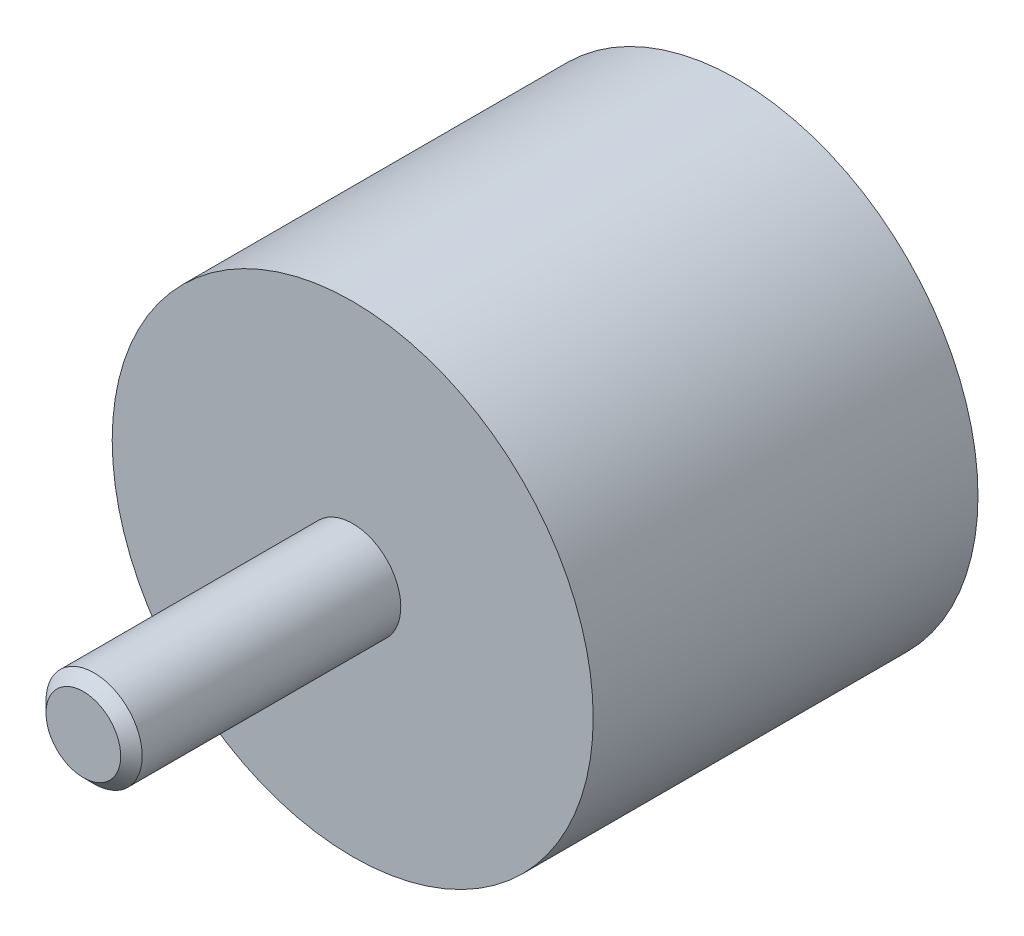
ISO-10303-21;
HEADER;
FILE_DESCRIPTION(('STEP AP214'),'2;1');
FILE_NAME('part.step','',(''),(''),'','','');
FILE_SCHEMA(('AUTOMOTIVE_DESIGN { 1 0 10303 214 1 1 1 1 }'));
ENDSEC;
DATA;
#1=APPLICATION_CONTEXT('core data for automotive mechanical design processes');
#2=APPLICATION_PROTOCOL_DEFINITION('international standard','automotive_design',2000,#1);
#3=PRODUCT_CONTEXT('',#1,'mechanical');
#4=PRODUCT('Part','Part','',(#3));
#5=PRODUCT_RELATED_PRODUCT_CATEGORY('part','',(#4));
#6=PRODUCT_DEFINITION_FORMATION('','',#4);
#7=PRODUCT_DEFINITION_CONTEXT('part definition',#1,'design');
#8=PRODUCT_DEFINITION('design','',#6,#7);
#9=PRODUCT_DEFINITION_SHAPE('','',#8);
#10=(LENGTH_UNIT() NAMED_UNIT(*) SI_UNIT(.MILLI.,.METRE.));
#11=(NAMED_UNIT(*) PLANE_ANGLE_UNIT() SI_UNIT($,.RADIAN.));
#12=(NAMED_UNIT(*) SI_UNIT($,.STERADIAN.) SOLID_ANGLE_UNIT());
#13=UNCERTAINTY_MEASURE_WITH_UNIT(LENGTH_MEASURE(1.E-05),#10,'distance_accuracy_value','');
#14=(GEOMETRIC_REPRESENTATION_CONTEXT(3) GLOBAL_UNCERTAINTY_ASSIGNED_CONTEXT((#13)) GLOBAL_UNIT_ASSIGNED_CONTEXT((#10,
#11,#12)) REPRESENTATION_CONTEXT('',''));
#15=CARTESIAN_POINT('',(0.,0.,0.));
#16=DIRECTION('',(0.,0.,1.));
#17=DIRECTION('',(1.,0.,0.));
#18=AXIS2_PLACEMENT_3D('',#15,#16,#17);
#19=CARTESIAN_POINT('',(0.,0.,0.));
#20=DIRECTION('',(0.,0.,1.));
#21=DIRECTION('',(0.,-1.,0.));
#22=AXIS2_PLACEMENT_3D('',#19,#20,#21);
#23=CYLINDRICAL_SURFACE('',#22,25.);
#24=CARTESIAN_POINT('',(0.,0.,0.));
#25=DIRECTION('',(0.,0.,1.));
#26=DIRECTION('',(0.,-1.,0.));
#27=AXIS2_PLACEMENT_3D('',#24,#25,#26);
#28=CIRCLE('',#27,25.);
#29=CARTESIAN_POINT('',(0.,-25.,0.));
#30=VERTEX_POINT('',#29);
#31=EDGE_CURVE('E18',#30,#30,#28,.T.);
#32=ORIENTED_EDGE('',*,*,#31,.T.);
#33=EDGE_LOOP('',(#32));
#34=FACE_BOUND('',#33,.T.);
#35=CARTESIAN_POINT('',(0.,0.,40.));
#36=DIRECTION('',(0.,0.,-1.));
#37=DIRECTION('',(0.,1.,0.));
#38=AXIS2_PLACEMENT_3D('',#35,#36,#37);
#39=CIRCLE('',#38,25.);
#40=CARTESIAN_POINT('',(0.,25.,40.));
#41=VERTEX_POINT('',#40);
#42=EDGE_CURVE('E22',#41,#41,#39,.T.);
#43=ORIENTED_EDGE('',*,*,#42,.T.);
#44=EDGE_LOOP('',(#43));
#45=FACE_BOUND('',#44,.T.);
#46=ADVANCED_FACE('F12',(#34,#45),#23,.T.);
#47=CARTESIAN_POINT('',(25.,0.,0.));
#48=DIRECTION('',(0.,0.,-1.));
#49=DIRECTION('',(0.,1.,0.));
#50=AXIS2_PLACEMENT_3D('',#47,#48,#49);
#51=PLANE('',#50);
#52=ORIENTED_EDGE('',*,*,#31,.F.);
#53=EDGE_LOOP('',(#52));
#54=FACE_BOUND('',#53,.T.);
#55=ADVANCED_FACE('F48',(#54),#51,.T.);
#56=CARTESIAN_POINT('',(25.,0.,40.));
#57=DIRECTION('',(0.,0.,1.));
#58=DIRECTION('',(0.,-1.,0.));
#59=AXIS2_PLACEMENT_3D('',#56,#57,#58);
#60=PLANE('',#59);
#61=CARTESIAN_POINT('',(0.,0.,40.));
#62=DIRECTION('',(0.,0.,1.));
#63=DIRECTION('',(0.,-1.,0.));
#64=AXIS2_PLACEMENT_3D('',#61,#62,#63);
#65=CIRCLE('',#64,5.);
#66=CARTESIAN_POINT('',(0.,-5.,40.));
#67=VERTEX_POINT('',#66);
#68=EDGE_CURVE('E8',#67,#67,#65,.F.);
#69=ORIENTED_EDGE('',*,*,#68,.T.);
#70=EDGE_LOOP('',(#69));
#71=FACE_BOUND('',#70,.T.);
#72=ORIENTED_EDGE('',*,*,#42,.F.);
#73=EDGE_LOOP('',(#72));
#74=FACE_BOUND('',#73,.T.);
#75=ADVANCED_FACE('F52',(#71,#74),#60,.T.);
#76=CARTESIAN_POINT('',(0.,0.,20.));
#77=DIRECTION('',(0.,0.,1.));
#78=DIRECTION('',(0.,-1.,0.));
#79=AXIS2_PLACEMENT_3D('',#76,#77,#78);
#80=CYLINDRICAL_SURFACE('',#79,5.);
#81=ORIENTED_EDGE('',*,*,#68,.F.);
#82=EDGE_LOOP('',(#81));
#83=FACE_BOUND('',#82,.T.);
#84=CARTESIAN_POINT('',(0.,0.,66.8809789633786));
#85=DIRECTION('',(0.,0.,-1.));
#86=DIRECTION('',(0.,1.,0.));
#87=AXIS2_PLACEMENT_3D('',#84,#85,#86);
#88=CIRCLE('',#87,5.);
#89=CARTESIAN_POINT('',(0.,5.,66.8809789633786));
#90=VERTEX_POINT('',#89);
#91=EDGE_CURVE('E26',#90,#90,#88,.T.);
#92=ORIENTED_EDGE('',*,*,#91,.T.);
#93=EDGE_LOOP('',(#92));
#94=FACE_BOUND('',#93,.T.);
#95=ADVANCED_FACE('F45',(#83,#94),#80,.T.);
#96=CARTESIAN_POINT('',(0.,0.,66.8809789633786));
#97=DIRECTION('',(0.,0.,-1.));
#98=DIRECTION('',(0.,1.,0.));
#99=AXIS2_PLACEMENT_3D('',#96,#97,#98);
#100=CONICAL_SURFACE('',#99,5.,0.78539816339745);
#101=CARTESIAN_POINT('',(0.,0.,68.));
#102=DIRECTION('',(0.,0.,-1.));
#103=DIRECTION('',(0.,1.,0.));
#104=AXIS2_PLACEMENT_3D('',#101,#102,#103);
#105=CIRCLE('',#104,3.88097896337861);
#106=CARTESIAN_POINT('',(0.,3.88097896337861,68.));
#107=VERTEX_POINT('',#106);
#108=EDGE_CURVE('E31',#107,#107,#105,.T.);
#109=ORIENTED_EDGE('',*,*,#108,.T.);
#110=EDGE_LOOP('',(#109));
#111=FACE_BOUND('',#110,.T.);
#112=ORIENTED_EDGE('',*,*,#91,.F.);
#113=EDGE_LOOP('',(#112));
#114=FACE_BOUND('',#113,.T.);
#115=ADVANCED_FACE('F35',(#111,#114),#100,.T.);
#116=CARTESIAN_POINT('',(3.88097896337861,0.,68.));
#117=DIRECTION('',(0.,0.,1.));
#118=DIRECTION('',(0.,-1.,0.));
#119=AXIS2_PLACEMENT_3D('',#116,#117,#118);
#120=PLANE('',#119);
#121=ORIENTED_EDGE('',*,*,#108,.F.);
#122=EDGE_LOOP('',(#121));
#123=FACE_BOUND('',#122,.T.);
#124=ADVANCED_FACE('F38',(#123),#120,.T.);
#125=CLOSED_SHELL('',(#46,#55,#75,#95,#115,#124));
#126=MANIFOLD_SOLID_BREP('B1',#125);
#127=ADVANCED_BREP_SHAPE_REPRESENTATION('',(#18,#126),#14);
#128=SHAPE_DEFINITION_REPRESENTATION(#9,#127);
ENDSEC;
END-ISO-10303-21;
